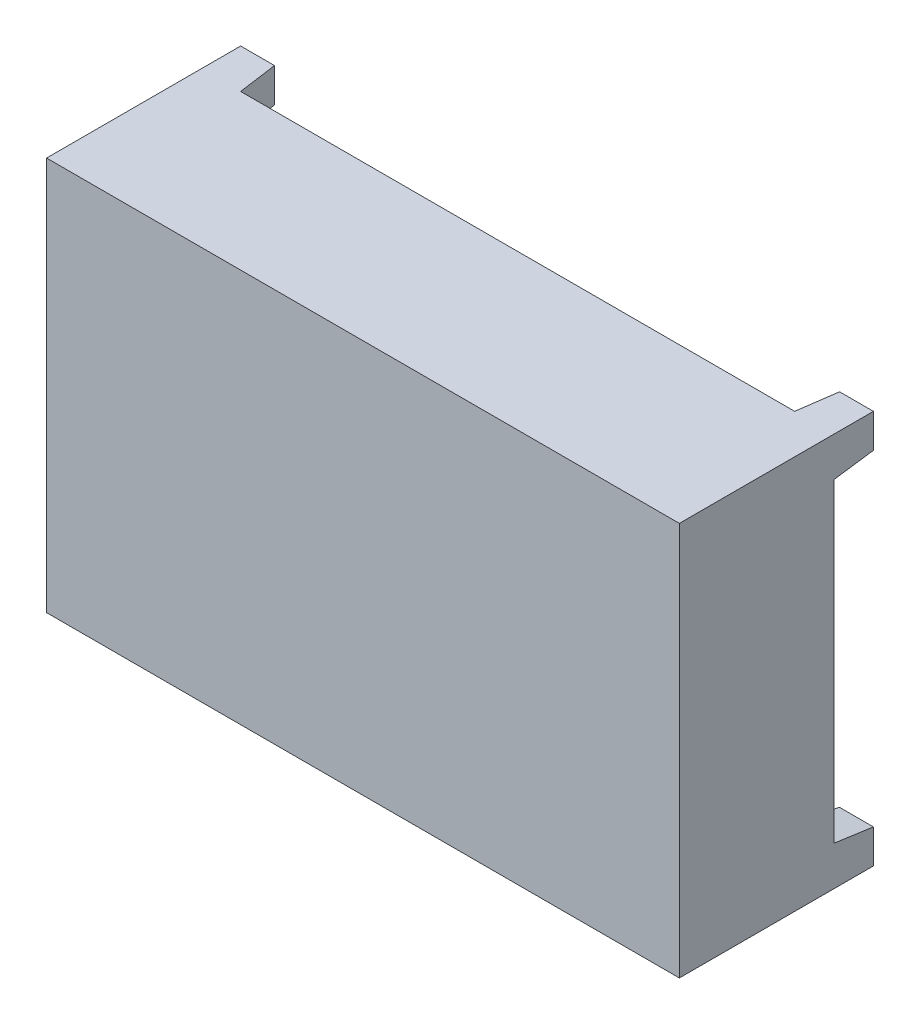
ISO-10303-21;
HEADER;
FILE_DESCRIPTION(('STEP AP214'),'2;1');
FILE_NAME('part.step','',(''),(''),'','','');
FILE_SCHEMA(('AUTOMOTIVE_DESIGN { 1 0 10303 214 1 1 1 1 }'));
ENDSEC;
DATA;
#1=APPLICATION_CONTEXT('core data for automotive mechanical design processes');
#2=APPLICATION_PROTOCOL_DEFINITION('international standard','automotive_design',2000,#1);
#3=PRODUCT_CONTEXT('',#1,'mechanical');
#4=PRODUCT('Part','Part','',(#3));
#5=PRODUCT_RELATED_PRODUCT_CATEGORY('part','',(#4));
#6=PRODUCT_DEFINITION_FORMATION('','',#4);
#7=PRODUCT_DEFINITION_CONTEXT('part definition',#1,'design');
#8=PRODUCT_DEFINITION('design','',#6,#7);
#9=PRODUCT_DEFINITION_SHAPE('','',#8);
#10=(LENGTH_UNIT() NAMED_UNIT(*) SI_UNIT(.MILLI.,.METRE.));
#11=(NAMED_UNIT(*) PLANE_ANGLE_UNIT() SI_UNIT($,.RADIAN.));
#12=(NAMED_UNIT(*) SI_UNIT($,.STERADIAN.) SOLID_ANGLE_UNIT());
#13=UNCERTAINTY_MEASURE_WITH_UNIT(LENGTH_MEASURE(1.E-05),#10,'distance_accuracy_value','');
#14=(GEOMETRIC_REPRESENTATION_CONTEXT(3) GLOBAL_UNCERTAINTY_ASSIGNED_CONTEXT((#13)) GLOBAL_UNIT_ASSIGNED_CONTEXT((#10,
#11,#12)) REPRESENTATION_CONTEXT('',''));
#15=CARTESIAN_POINT('',(0.,0.,0.));
#16=DIRECTION('',(0.,0.,1.));
#17=DIRECTION('',(1.,0.,0.));
#18=AXIS2_PLACEMENT_3D('',#15,#16,#17);
#19=CARTESIAN_POINT('',(0.,0.,-2.75));
#20=DIRECTION('',(0.,0.,-1.));
#21=DIRECTION('',(-1.,0.,0.));
#22=AXIS2_PLACEMENT_3D('',#19,#20,#21);
#23=PLANE('',#22);
#24=DIRECTION('',(0.,-1.,0.));
#25=VECTOR('',#24,1.);
#26=CARTESIAN_POINT('',(-22.5,0.,-2.75));
#27=LINE('',#26,#25);
#28=CARTESIAN_POINT('',(-22.5,-1.40000000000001,-2.75));
#29=VERTEX_POINT('',#28);
#30=CARTESIAN_POINT('',(-22.5,-12.6,-2.75));
#31=VERTEX_POINT('',#30);
#32=EDGE_CURVE('E235',#29,#31,#27,.T.);
#33=ORIENTED_EDGE('',*,*,#32,.F.);
#34=DIRECTION('',(1.,0.,0.));
#35=VECTOR('',#34,1.);
#36=CARTESIAN_POINT('',(0.,-1.40000000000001,-2.75));
#37=LINE('',#36,#35);
#38=CARTESIAN_POINT('',(-21.1,-1.40000000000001,-2.75));
#39=VERTEX_POINT('',#38);
#40=EDGE_CURVE('E297',#29,#39,#37,.T.);
#41=ORIENTED_EDGE('',*,*,#40,.T.);
#42=DIRECTION('',(0.,1.,0.));
#43=VECTOR('',#42,1.);
#44=CARTESIAN_POINT('',(-21.1,0.,-2.75));
#45=LINE('',#44,#43);
#46=CARTESIAN_POINT('',(-21.1,0.,-2.75));
#47=VERTEX_POINT('',#46);
#48=EDGE_CURVE('E252',#39,#47,#45,.T.);
#49=ORIENTED_EDGE('',*,*,#48,.T.);
#50=DIRECTION('',(-1.,0.,0.));
#51=VECTOR('',#50,1.);
#52=CARTESIAN_POINT('',(0.,0.,-2.75));
#53=LINE('',#52,#51);
#54=CARTESIAN_POINT('',(-1.40000000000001,0.,-2.75));
#55=VERTEX_POINT('',#54);
#56=EDGE_CURVE('E231',#55,#47,#53,.T.);
#57=ORIENTED_EDGE('',*,*,#56,.F.);
#58=DIRECTION('',(0.,-1.,0.));
#59=VECTOR('',#58,1.);
#60=CARTESIAN_POINT('',(-1.40000000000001,0.,-2.75));
#61=LINE('',#60,#59);
#62=CARTESIAN_POINT('',(-1.40000000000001,-1.40000000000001,-2.75));
#63=VERTEX_POINT('',#62);
#64=EDGE_CURVE('E249',#55,#63,#61,.T.);
#65=ORIENTED_EDGE('',*,*,#64,.T.);
#66=DIRECTION('',(1.,0.,0.));
#67=VECTOR('',#66,1.);
#68=CARTESIAN_POINT('',(0.,-1.40000000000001,-2.75));
#69=LINE('',#68,#67);
#70=CARTESIAN_POINT('',(0.,-1.40000000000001,-2.75));
#71=VERTEX_POINT('',#70);
#72=EDGE_CURVE('E285',#63,#71,#69,.T.);
#73=ORIENTED_EDGE('',*,*,#72,.T.);
#74=DIRECTION('',(0.,1.,0.));
#75=VECTOR('',#74,1.);
#76=CARTESIAN_POINT('',(0.,0.,-2.75));
#77=LINE('',#76,#75);
#78=CARTESIAN_POINT('',(0.,-12.6,-2.75));
#79=VERTEX_POINT('',#78);
#80=EDGE_CURVE('E216',#79,#71,#77,.T.);
#81=ORIENTED_EDGE('',*,*,#80,.F.);
#82=DIRECTION('',(-1.,0.,0.));
#83=VECTOR('',#82,1.);
#84=CARTESIAN_POINT('',(0.,-12.6,-2.75));
#85=LINE('',#84,#83);
#86=CARTESIAN_POINT('',(-1.40000000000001,-12.6,-2.75));
#87=VERTEX_POINT('',#86);
#88=EDGE_CURVE('E289',#79,#87,#85,.T.);
#89=ORIENTED_EDGE('',*,*,#88,.T.);
#90=DIRECTION('',(0.,-1.,0.));
#91=VECTOR('',#90,1.);
#92=CARTESIAN_POINT('',(-1.4,0.,-2.75));
#93=LINE('',#92,#91);
#94=CARTESIAN_POINT('',(-1.40000000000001,-14.,-2.75));
#95=VERTEX_POINT('',#94);
#96=EDGE_CURVE('E259',#87,#95,#93,.T.);
#97=ORIENTED_EDGE('',*,*,#96,.T.);
#98=DIRECTION('',(1.,0.,0.));
#99=VECTOR('',#98,1.);
#100=CARTESIAN_POINT('',(0.,-14.,-2.75));
#101=LINE('',#100,#99);
#102=CARTESIAN_POINT('',(-21.1,-14.,-2.75));
#103=VERTEX_POINT('',#102);
#104=EDGE_CURVE('E220',#103,#95,#101,.T.);
#105=ORIENTED_EDGE('',*,*,#104,.F.);
#106=DIRECTION('',(0.,1.,0.));
#107=VECTOR('',#106,1.);
#108=CARTESIAN_POINT('',(-21.1,0.,-2.75));
#109=LINE('',#108,#107);
#110=CARTESIAN_POINT('',(-21.1,-12.6,-2.75));
#111=VERTEX_POINT('',#110);
#112=EDGE_CURVE('E256',#103,#111,#109,.T.);
#113=ORIENTED_EDGE('',*,*,#112,.T.);
#114=DIRECTION('',(-1.,0.,0.));
#115=VECTOR('',#114,1.);
#116=CARTESIAN_POINT('',(0.,-12.6,-2.75));
#117=LINE('',#116,#115);
#118=EDGE_CURVE('E293',#111,#31,#117,.T.);
#119=ORIENTED_EDGE('',*,*,#118,.T.);
#120=EDGE_LOOP('',(#33,#41,#49,#57,#65,#73,#81,#89,#97,#105,#113,#119));
#121=FACE_BOUND('',#120,.T.);
#122=ADVANCED_FACE('F41',(#121),#23,.T.);
#123=CARTESIAN_POINT('',(0.,0.,2.75));
#124=DIRECTION('',(-1.,0.,0.));
#125=DIRECTION('',(0.,-1.,0.));
#126=AXIS2_PLACEMENT_3D('',#123,#124,#125);
#127=PLANE('',#126);
#128=DIRECTION('',(0.,0.,-1.));
#129=VECTOR('',#128,1.);
#130=CARTESIAN_POINT('',(0.,-14.,2.75));
#131=LINE('',#130,#129);
#132=CARTESIAN_POINT('',(0.,-14.,2.75));
#133=VERTEX_POINT('',#132);
#134=CARTESIAN_POINT('',(0.,-14.,-4.15));
#135=VERTEX_POINT('',#134);
#136=EDGE_CURVE('E168',#133,#135,#131,.T.);
#137=ORIENTED_EDGE('',*,*,#136,.T.);
#138=DIRECTION('',(0.,-1.,0.));
#139=VECTOR('',#138,1.);
#140=CARTESIAN_POINT('',(0.,0.,-4.15));
#141=LINE('',#140,#139);
#142=CARTESIAN_POINT('',(0.,-12.7967571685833,-4.15));
#143=VERTEX_POINT('',#142);
#144=EDGE_CURVE('E171',#143,#135,#141,.T.);
#145=ORIENTED_EDGE('',*,*,#144,.F.);
#146=DIRECTION('',(0.,0.139173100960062,0.990268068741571));
#147=VECTOR('',#146,1.);
#148=CARTESIAN_POINT('',(0.,-11.5979459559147,4.37998500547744));
#149=LINE('',#148,#147);
#150=EDGE_CURVE('E323',#143,#79,#149,.T.);
#151=ORIENTED_EDGE('',*,*,#150,.T.);
#152=ORIENTED_EDGE('',*,*,#80,.T.);
#153=DIRECTION('',(0.,0.139173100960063,-0.990268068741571));
#154=VECTOR('',#153,1.);
#155=CARTESIAN_POINT('',(0.,-2.13088591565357,2.45052351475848));
#156=LINE('',#155,#154);
#157=CARTESIAN_POINT('',(0.,-1.20324283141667,-4.15));
#158=VERTEX_POINT('',#157);
#159=EDGE_CURVE('E11',#71,#158,#156,.T.);
#160=ORIENTED_EDGE('',*,*,#159,.T.);
#161=DIRECTION('',(0.,-1.,0.));
#162=VECTOR('',#161,1.);
#163=CARTESIAN_POINT('',(0.,0.,-4.15));
#164=LINE('',#163,#162);
#165=CARTESIAN_POINT('',(0.,0.,-4.15));
#166=VERTEX_POINT('',#165);
#167=EDGE_CURVE('E57',#166,#158,#164,.T.);
#168=ORIENTED_EDGE('',*,*,#167,.F.);
#169=DIRECTION('',(0.,0.,-1.));
#170=VECTOR('',#169,1.);
#171=CARTESIAN_POINT('',(0.,0.,2.75));
#172=LINE('',#171,#170);
#173=CARTESIAN_POINT('',(0.,0.,2.75));
#174=VERTEX_POINT('',#173);
#175=EDGE_CURVE('E246',#174,#166,#172,.T.);
#176=ORIENTED_EDGE('',*,*,#175,.F.);
#177=DIRECTION('',(0.,1.,0.));
#178=VECTOR('',#177,1.);
#179=CARTESIAN_POINT('',(0.,0.,2.75));
#180=LINE('',#179,#178);
#181=EDGE_CURVE('E175',#133,#174,#180,.T.);
#182=ORIENTED_EDGE('',*,*,#181,.F.);
#183=EDGE_LOOP('',(#137,#145,#151,#152,#160,#168,#176,#182));
#184=FACE_BOUND('',#183,.T.);
#185=ADVANCED_FACE('F170',(#184),#127,.F.);
#186=CARTESIAN_POINT('',(0.,0.,2.75));
#187=DIRECTION('',(0.,-1.,0.));
#188=DIRECTION('',(0.,0.,-1.));
#189=AXIS2_PLACEMENT_3D('',#186,#187,#188);
#190=PLANE('',#189);
#191=ORIENTED_EDGE('',*,*,#175,.T.);
#192=DIRECTION('',(1.,0.,0.));
#193=VECTOR('',#192,1.);
#194=CARTESIAN_POINT('',(0.,0.,-4.15));
#195=LINE('',#194,#193);
#196=CARTESIAN_POINT('',(-1.20324283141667,0.,-4.15));
#197=VERTEX_POINT('',#196);
#198=EDGE_CURVE('E204',#197,#166,#195,.T.);
#199=ORIENTED_EDGE('',*,*,#198,.F.);
#200=DIRECTION('',(-0.139173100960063,0.,0.990268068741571));
#201=VECTOR('',#200,1.);
#202=CARTESIAN_POINT('',(-2.13088591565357,0.,2.45052351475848));
#203=LINE('',#202,#201);
#204=EDGE_CURVE('E282',#197,#55,#203,.T.);
#205=ORIENTED_EDGE('',*,*,#204,.T.);
#206=ORIENTED_EDGE('',*,*,#56,.T.);
#207=DIRECTION('',(-0.139173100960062,0.,-0.990268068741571));
#208=VECTOR('',#207,1.);
#209=CARTESIAN_POINT('',(-19.9333081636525,0.,5.55144376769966));
#210=LINE('',#209,#208);
#211=CARTESIAN_POINT('',(-21.2967571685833,0.,-4.15));
#212=VERTEX_POINT('',#211);
#213=EDGE_CURVE('E276',#47,#212,#210,.T.);
#214=ORIENTED_EDGE('',*,*,#213,.T.);
#215=DIRECTION('',(1.,0.,0.));
#216=VECTOR('',#215,1.);
#217=CARTESIAN_POINT('',(0.,0.,-4.15));
#218=LINE('',#217,#216);
#219=CARTESIAN_POINT('',(-22.5,0.,-4.15));
#220=VERTEX_POINT('',#219);
#221=EDGE_CURVE('E213',#220,#212,#218,.T.);
#222=ORIENTED_EDGE('',*,*,#221,.F.);
#223=DIRECTION('',(0.,0.,-1.));
#224=VECTOR('',#223,1.);
#225=CARTESIAN_POINT('',(-22.5,0.,2.75));
#226=LINE('',#225,#224);
#227=CARTESIAN_POINT('',(-22.5,0.,2.75));
#228=VERTEX_POINT('',#227);
#229=EDGE_CURVE('E243',#228,#220,#226,.T.);
#230=ORIENTED_EDGE('',*,*,#229,.F.);
#231=DIRECTION('',(-1.,0.,0.));
#232=VECTOR('',#231,1.);
#233=CARTESIAN_POINT('',(0.,0.,2.75));
#234=LINE('',#233,#232);
#235=EDGE_CURVE('E219',#174,#228,#234,.T.);
#236=ORIENTED_EDGE('',*,*,#235,.F.);
#237=EDGE_LOOP('',(#191,#199,#205,#206,#214,#222,#230,#236));
#238=FACE_BOUND('',#237,.T.);
#239=ADVANCED_FACE('F365',(#238),#190,.F.);
#240=CARTESIAN_POINT('',(-22.5,0.,2.75));
#241=DIRECTION('',(1.,0.,0.));
#242=DIRECTION('',(0.,0.,-1.));
#243=AXIS2_PLACEMENT_3D('',#240,#241,#242);
#244=PLANE('',#243);
#245=ORIENTED_EDGE('',*,*,#229,.T.);
#246=DIRECTION('',(0.,1.,0.));
#247=VECTOR('',#246,1.);
#248=CARTESIAN_POINT('',(-22.5,0.,-4.15));
#249=LINE('',#248,#247);
#250=CARTESIAN_POINT('',(-22.5,-1.20324283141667,-4.15));
#251=VERTEX_POINT('',#250);
#252=EDGE_CURVE('E209',#251,#220,#249,.T.);
#253=ORIENTED_EDGE('',*,*,#252,.F.);
#254=DIRECTION('',(0.,-0.139173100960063,0.990268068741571));
#255=VECTOR('',#254,1.);
#256=CARTESIAN_POINT('',(-22.5,-2.13088591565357,2.45052351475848));
#257=LINE('',#256,#255);
#258=EDGE_CURVE('E305',#251,#29,#257,.T.);
#259=ORIENTED_EDGE('',*,*,#258,.T.);
#260=ORIENTED_EDGE('',*,*,#32,.T.);
#261=DIRECTION('',(0.,-0.139173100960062,-0.990268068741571));
#262=VECTOR('',#261,1.);
#263=CARTESIAN_POINT('',(-22.5,-11.5979459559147,4.37998500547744));
#264=LINE('',#263,#262);
#265=CARTESIAN_POINT('',(-22.5,-12.7967571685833,-4.15));
#266=VERTEX_POINT('',#265);
#267=EDGE_CURVE('E318',#31,#266,#264,.T.);
#268=ORIENTED_EDGE('',*,*,#267,.T.);
#269=DIRECTION('',(0.,1.,0.));
#270=VECTOR('',#269,1.);
#271=CARTESIAN_POINT('',(-22.5,0.,-4.15));
#272=LINE('',#271,#270);
#273=CARTESIAN_POINT('',(-22.5,-14.,-4.15));
#274=VERTEX_POINT('',#273);
#275=EDGE_CURVE('E82',#274,#266,#272,.T.);
#276=ORIENTED_EDGE('',*,*,#275,.F.);
#277=DIRECTION('',(0.,0.,-1.));
#278=VECTOR('',#277,1.);
#279=CARTESIAN_POINT('',(-22.5,-14.,2.75));
#280=LINE('',#279,#278);
#281=CARTESIAN_POINT('',(-22.5,-14.,2.75));
#282=VERTEX_POINT('',#281);
#283=EDGE_CURVE('E180',#282,#274,#280,.T.);
#284=ORIENTED_EDGE('',*,*,#283,.F.);
#285=DIRECTION('',(0.,-1.,0.));
#286=VECTOR('',#285,1.);
#287=CARTESIAN_POINT('',(-22.5,0.,2.75));
#288=LINE('',#287,#286);
#289=EDGE_CURVE('E223',#228,#282,#288,.T.);
#290=ORIENTED_EDGE('',*,*,#289,.F.);
#291=EDGE_LOOP('',(#245,#253,#259,#260,#268,#276,#284,#290));
#292=FACE_BOUND('',#291,.T.);
#293=ADVANCED_FACE('F356',(#292),#244,.F.);
#294=CARTESIAN_POINT('',(0.,-14.,2.75));
#295=DIRECTION('',(0.,1.,0.));
#296=DIRECTION('',(-1.,0.,0.));
#297=AXIS2_PLACEMENT_3D('',#294,#295,#296);
#298=PLANE('',#297);
#299=ORIENTED_EDGE('',*,*,#283,.T.);
#300=DIRECTION('',(-1.,0.,0.));
#301=VECTOR('',#300,1.);
#302=CARTESIAN_POINT('',(0.,-14.,-4.15));
#303=LINE('',#302,#301);
#304=CARTESIAN_POINT('',(-21.2967571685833,-14.,-4.15));
#305=VERTEX_POINT('',#304);
#306=EDGE_CURVE('E197',#305,#274,#303,.T.);
#307=ORIENTED_EDGE('',*,*,#306,.F.);
#308=DIRECTION('',(0.139173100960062,0.,0.990268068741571));
#309=VECTOR('',#308,1.);
#310=CARTESIAN_POINT('',(-19.9333081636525,-14.,5.55144376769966));
#311=LINE('',#310,#309);
#312=EDGE_CURVE('E270',#305,#103,#311,.T.);
#313=ORIENTED_EDGE('',*,*,#312,.T.);
#314=ORIENTED_EDGE('',*,*,#104,.T.);
#315=DIRECTION('',(0.139173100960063,0.,-0.990268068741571));
#316=VECTOR('',#315,1.);
#317=CARTESIAN_POINT('',(-2.13088591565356,-14.,2.45052351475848));
#318=LINE('',#317,#316);
#319=CARTESIAN_POINT('',(-1.20324283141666,-14.,-4.15));
#320=VERTEX_POINT('',#319);
#321=EDGE_CURVE('E194',#95,#320,#318,.T.);
#322=ORIENTED_EDGE('',*,*,#321,.T.);
#323=DIRECTION('',(-1.,0.,0.));
#324=VECTOR('',#323,1.);
#325=CARTESIAN_POINT('',(0.,-14.,-4.15));
#326=LINE('',#325,#324);
#327=EDGE_CURVE('E185',#135,#320,#326,.T.);
#328=ORIENTED_EDGE('',*,*,#327,.F.);
#329=ORIENTED_EDGE('',*,*,#136,.F.);
#330=DIRECTION('',(1.,0.,0.));
#331=VECTOR('',#330,1.);
#332=CARTESIAN_POINT('',(0.,-14.,2.75));
#333=LINE('',#332,#331);
#334=EDGE_CURVE('E181',#282,#133,#333,.T.);
#335=ORIENTED_EDGE('',*,*,#334,.F.);
#336=EDGE_LOOP('',(#299,#307,#313,#314,#322,#328,#329,#335));
#337=FACE_BOUND('',#336,.T.);
#338=ADVANCED_FACE('F192',(#337),#298,.F.);
#339=CARTESIAN_POINT('',(0.,0.,2.75));
#340=DIRECTION('',(0.,0.,-1.));
#341=DIRECTION('',(-1.,0.,0.));
#342=AXIS2_PLACEMENT_3D('',#339,#340,#341);
#343=PLANE('',#342);
#344=ORIENTED_EDGE('',*,*,#181,.T.);
#345=ORIENTED_EDGE('',*,*,#235,.T.);
#346=ORIENTED_EDGE('',*,*,#289,.T.);
#347=ORIENTED_EDGE('',*,*,#334,.T.);
#348=EDGE_LOOP('',(#344,#345,#346,#347));
#349=FACE_BOUND('',#348,.T.);
#350=ADVANCED_FACE('F378',(#349),#343,.F.);
#351=CARTESIAN_POINT('',(0.,0.,-4.15));
#352=DIRECTION('',(0.,0.,-1.));
#353=DIRECTION('',(-1.,0.,0.));
#354=AXIS2_PLACEMENT_3D('',#351,#352,#353);
#355=PLANE('',#354);
#356=ORIENTED_EDGE('',*,*,#221,.T.);
#357=DIRECTION('',(0.,-1.,0.));
#358=VECTOR('',#357,1.);
#359=CARTESIAN_POINT('',(-21.2967571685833,0.,-4.15));
#360=LINE('',#359,#358);
#361=CARTESIAN_POINT('',(-21.2967571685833,-1.20324283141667,-4.15));
#362=VERTEX_POINT('',#361);
#363=EDGE_CURVE('E273',#212,#362,#360,.T.);
#364=ORIENTED_EDGE('',*,*,#363,.T.);
#365=DIRECTION('',(-1.,0.,0.));
#366=VECTOR('',#365,1.);
#367=CARTESIAN_POINT('',(0.,-1.20324283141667,-4.15));
#368=LINE('',#367,#366);
#369=EDGE_CURVE('E301',#362,#251,#368,.T.);
#370=ORIENTED_EDGE('',*,*,#369,.T.);
#371=ORIENTED_EDGE('',*,*,#252,.T.);
#372=EDGE_LOOP('',(#356,#364,#370,#371));
#373=FACE_BOUND('',#372,.T.);
#374=ADVANCED_FACE('F371',(#373),#355,.T.);
#375=CARTESIAN_POINT('',(0.,0.,-4.15));
#376=DIRECTION('',(0.,0.,-1.));
#377=DIRECTION('',(-1.,0.,0.));
#378=AXIS2_PLACEMENT_3D('',#375,#376,#377);
#379=PLANE('',#378);
#380=ORIENTED_EDGE('',*,*,#167,.T.);
#381=DIRECTION('',(-1.,0.,0.));
#382=VECTOR('',#381,1.);
#383=CARTESIAN_POINT('',(0.,-1.20324283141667,-4.15));
#384=LINE('',#383,#382);
#385=CARTESIAN_POINT('',(-1.20324283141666,-1.20324283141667,-4.15));
#386=VERTEX_POINT('',#385);
#387=EDGE_CURVE('E330',#158,#386,#384,.T.);
#388=ORIENTED_EDGE('',*,*,#387,.T.);
#389=DIRECTION('',(0.,1.,0.));
#390=VECTOR('',#389,1.);
#391=CARTESIAN_POINT('',(-1.20324283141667,0.,-4.15));
#392=LINE('',#391,#390);
#393=EDGE_CURVE('E65',#386,#197,#392,.T.);
#394=ORIENTED_EDGE('',*,*,#393,.T.);
#395=ORIENTED_EDGE('',*,*,#198,.T.);
#396=EDGE_LOOP('',(#380,#388,#394,#395));
#397=FACE_BOUND('',#396,.T.);
#398=ADVANCED_FACE('F368',(#397),#379,.T.);
#399=CARTESIAN_POINT('',(0.,0.,-4.15));
#400=DIRECTION('',(0.,0.,-1.));
#401=DIRECTION('',(-1.,0.,0.));
#402=AXIS2_PLACEMENT_3D('',#399,#400,#401);
#403=PLANE('',#402);
#404=ORIENTED_EDGE('',*,*,#275,.T.);
#405=DIRECTION('',(1.,0.,0.));
#406=VECTOR('',#405,1.);
#407=CARTESIAN_POINT('',(0.,-12.7967571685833,-4.15));
#408=LINE('',#407,#406);
#409=CARTESIAN_POINT('',(-21.2967571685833,-12.7967571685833,-4.15));
#410=VERTEX_POINT('',#409);
#411=EDGE_CURVE('E312',#266,#410,#408,.T.);
#412=ORIENTED_EDGE('',*,*,#411,.T.);
#413=DIRECTION('',(0.,-1.,0.));
#414=VECTOR('',#413,1.);
#415=CARTESIAN_POINT('',(-21.2967571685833,0.,-4.15));
#416=LINE('',#415,#414);
#417=EDGE_CURVE('E90',#410,#305,#416,.T.);
#418=ORIENTED_EDGE('',*,*,#417,.T.);
#419=ORIENTED_EDGE('',*,*,#306,.T.);
#420=EDGE_LOOP('',(#404,#412,#418,#419));
#421=FACE_BOUND('',#420,.T.);
#422=ADVANCED_FACE('F370',(#421),#403,.T.);
#423=CARTESIAN_POINT('',(0.,0.,-4.15));
#424=DIRECTION('',(0.,0.,-1.));
#425=DIRECTION('',(-1.,0.,0.));
#426=AXIS2_PLACEMENT_3D('',#423,#424,#425);
#427=PLANE('',#426);
#428=ORIENTED_EDGE('',*,*,#327,.T.);
#429=DIRECTION('',(0.,1.,0.));
#430=VECTOR('',#429,1.);
#431=CARTESIAN_POINT('',(-1.20324283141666,0.,-4.15));
#432=LINE('',#431,#430);
#433=CARTESIAN_POINT('',(-1.20324283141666,-12.7967571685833,-4.15));
#434=VERTEX_POINT('',#433);
#435=EDGE_CURVE('E263',#320,#434,#432,.T.);
#436=ORIENTED_EDGE('',*,*,#435,.T.);
#437=DIRECTION('',(1.,0.,0.));
#438=VECTOR('',#437,1.);
#439=CARTESIAN_POINT('',(0.,-12.7967571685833,-4.15));
#440=LINE('',#439,#438);
#441=EDGE_CURVE('E188',#434,#143,#440,.T.);
#442=ORIENTED_EDGE('',*,*,#441,.T.);
#443=ORIENTED_EDGE('',*,*,#144,.T.);
#444=EDGE_LOOP('',(#428,#436,#442,#443));
#445=FACE_BOUND('',#444,.T.);
#446=ADVANCED_FACE('F184',(#445),#427,.T.);
#447=CARTESIAN_POINT('',(-1.19999999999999,0.,-4.17307394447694));
#448=DIRECTION('',(0.990268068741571,0.,0.139173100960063));
#449=DIRECTION('',(0.,1.,0.));
#450=AXIS2_PLACEMENT_3D('',#447,#448,#449);
#451=PLANE('',#450);
#452=ORIENTED_EDGE('',*,*,#321,.F.);
#453=ORIENTED_EDGE('',*,*,#96,.F.);
#454=DIRECTION('',(0.137844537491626,-0.137844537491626,-0.98081484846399));
#455=VECTOR('',#454,1.);
#456=CARTESIAN_POINT('',(-1.44321429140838,-12.5567857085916,-2.44251433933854));
#457=LINE('',#456,#455);
#458=EDGE_CURVE('E326',#87,#434,#457,.T.);
#459=ORIENTED_EDGE('',*,*,#458,.T.);
#460=ORIENTED_EDGE('',*,*,#435,.F.);
#461=EDGE_LOOP('',(#452,#453,#459,#460));
#462=FACE_BOUND('',#461,.T.);
#463=ADVANCED_FACE('F395',(#462),#451,.F.);
#464=CARTESIAN_POINT('',(-21.3,0.,-4.17307394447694));
#465=DIRECTION('',(-0.990268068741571,0.,0.139173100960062));
#466=DIRECTION('',(0.,-1.,0.));
#467=AXIS2_PLACEMENT_3D('',#464,#465,#466);
#468=PLANE('',#467);
#469=ORIENTED_EDGE('',*,*,#417,.F.);
#470=DIRECTION('',(0.137844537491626,0.137844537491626,0.98081484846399));
#471=VECTOR('',#470,1.);
#472=CARTESIAN_POINT('',(-21.0567857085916,-12.5567857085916,-2.44251433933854));
#473=LINE('',#472,#471);
#474=EDGE_CURVE('E315',#410,#111,#473,.T.);
#475=ORIENTED_EDGE('',*,*,#474,.T.);
#476=ORIENTED_EDGE('',*,*,#112,.F.);
#477=ORIENTED_EDGE('',*,*,#312,.F.);
#478=EDGE_LOOP('',(#469,#475,#476,#477));
#479=FACE_BOUND('',#478,.T.);
#480=ADVANCED_FACE('F350',(#479),#468,.F.);
#481=CARTESIAN_POINT('',(-21.3,0.,-4.17307394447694));
#482=DIRECTION('',(-0.990268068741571,0.,0.139173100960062));
#483=DIRECTION('',(0.,-1.,0.));
#484=AXIS2_PLACEMENT_3D('',#481,#482,#483);
#485=PLANE('',#484);
#486=ORIENTED_EDGE('',*,*,#213,.F.);
#487=ORIENTED_EDGE('',*,*,#48,.F.);
#488=DIRECTION('',(-0.137844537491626,0.137844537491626,-0.98081484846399));
#489=VECTOR('',#488,1.);
#490=CARTESIAN_POINT('',(-21.3228013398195,-1.17719866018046,-4.33531390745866));
#491=LINE('',#490,#489);
#492=EDGE_CURVE('E308',#39,#362,#491,.T.);
#493=ORIENTED_EDGE('',*,*,#492,.T.);
#494=ORIENTED_EDGE('',*,*,#363,.F.);
#495=EDGE_LOOP('',(#486,#487,#493,#494));
#496=FACE_BOUND('',#495,.T.);
#497=ADVANCED_FACE('F400',(#496),#485,.F.);
#498=CARTESIAN_POINT('',(-1.2,0.,-4.17307394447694));
#499=DIRECTION('',(0.990268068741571,0.,0.139173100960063));
#500=DIRECTION('',(0.,1.,0.));
#501=AXIS2_PLACEMENT_3D('',#498,#499,#500);
#502=PLANE('',#501);
#503=ORIENTED_EDGE('',*,*,#393,.F.);
#504=DIRECTION('',(-0.137844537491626,-0.137844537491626,0.98081484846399));
#505=VECTOR('',#504,1.);
#506=CARTESIAN_POINT('',(-1.17719866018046,-1.17719866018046,-4.33531390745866));
#507=LINE('',#506,#505);
#508=EDGE_CURVE('E50',#386,#63,#507,.T.);
#509=ORIENTED_EDGE('',*,*,#508,.T.);
#510=ORIENTED_EDGE('',*,*,#64,.F.);
#511=ORIENTED_EDGE('',*,*,#204,.F.);
#512=EDGE_LOOP('',(#503,#509,#510,#511));
#513=FACE_BOUND('',#512,.T.);
#514=ADVANCED_FACE('F336',(#513),#502,.F.);
#515=CARTESIAN_POINT('',(0.,-1.2,-4.17307394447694));
#516=DIRECTION('',(0.,0.990268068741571,0.139173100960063));
#517=DIRECTION('',(-1.,0.,0.));
#518=AXIS2_PLACEMENT_3D('',#515,#516,#517);
#519=PLANE('',#518);
#520=ORIENTED_EDGE('',*,*,#492,.F.);
#521=ORIENTED_EDGE('',*,*,#40,.F.);
#522=ORIENTED_EDGE('',*,*,#258,.F.);
#523=ORIENTED_EDGE('',*,*,#369,.F.);
#524=EDGE_LOOP('',(#520,#521,#522,#523));
#525=FACE_BOUND('',#524,.T.);
#526=ADVANCED_FACE('F362',(#525),#519,.F.);
#527=CARTESIAN_POINT('',(0.,-12.8,-4.17307394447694));
#528=DIRECTION('',(0.,-0.990268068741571,0.139173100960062));
#529=DIRECTION('',(1.,0.,0.));
#530=AXIS2_PLACEMENT_3D('',#527,#528,#529);
#531=PLANE('',#530);
#532=ORIENTED_EDGE('',*,*,#267,.F.);
#533=ORIENTED_EDGE('',*,*,#118,.F.);
#534=ORIENTED_EDGE('',*,*,#474,.F.);
#535=ORIENTED_EDGE('',*,*,#411,.F.);
#536=EDGE_LOOP('',(#532,#533,#534,#535));
#537=FACE_BOUND('',#536,.T.);
#538=ADVANCED_FACE('F407',(#537),#531,.F.);
#539=CARTESIAN_POINT('',(0.,-12.8,-4.17307394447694));
#540=DIRECTION('',(0.,-0.990268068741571,0.139173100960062));
#541=DIRECTION('',(1.,0.,0.));
#542=AXIS2_PLACEMENT_3D('',#539,#540,#541);
#543=PLANE('',#542);
#544=ORIENTED_EDGE('',*,*,#458,.F.);
#545=ORIENTED_EDGE('',*,*,#88,.F.);
#546=ORIENTED_EDGE('',*,*,#150,.F.);
#547=ORIENTED_EDGE('',*,*,#441,.F.);
#548=EDGE_LOOP('',(#544,#545,#546,#547));
#549=FACE_BOUND('',#548,.T.);
#550=ADVANCED_FACE('F346',(#549),#543,.F.);
#551=CARTESIAN_POINT('',(0.,-1.2,-4.17307394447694));
#552=DIRECTION('',(0.,0.990268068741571,0.139173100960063));
#553=DIRECTION('',(-1.,0.,0.));
#554=AXIS2_PLACEMENT_3D('',#551,#552,#553);
#555=PLANE('',#554);
#556=ORIENTED_EDGE('',*,*,#159,.F.);
#557=ORIENTED_EDGE('',*,*,#72,.F.);
#558=ORIENTED_EDGE('',*,*,#508,.F.);
#559=ORIENTED_EDGE('',*,*,#387,.F.);
#560=EDGE_LOOP('',(#556,#557,#558,#559));
#561=FACE_BOUND('',#560,.T.);
#562=ADVANCED_FACE('F43',(#561),#555,.F.);
#563=CLOSED_SHELL('',(#122,#185,#239,#293,#338,#350,#374,#398,#422,#446,#463,#480,#497,#514,
#526,#538,#550,#562));
#564=MANIFOLD_SOLID_BREP('B2',#563);
#565=ADVANCED_BREP_SHAPE_REPRESENTATION('',(#18,#564),#14);
#566=SHAPE_DEFINITION_REPRESENTATION(#9,#565);
ENDSEC;
END-ISO-10303-21;
